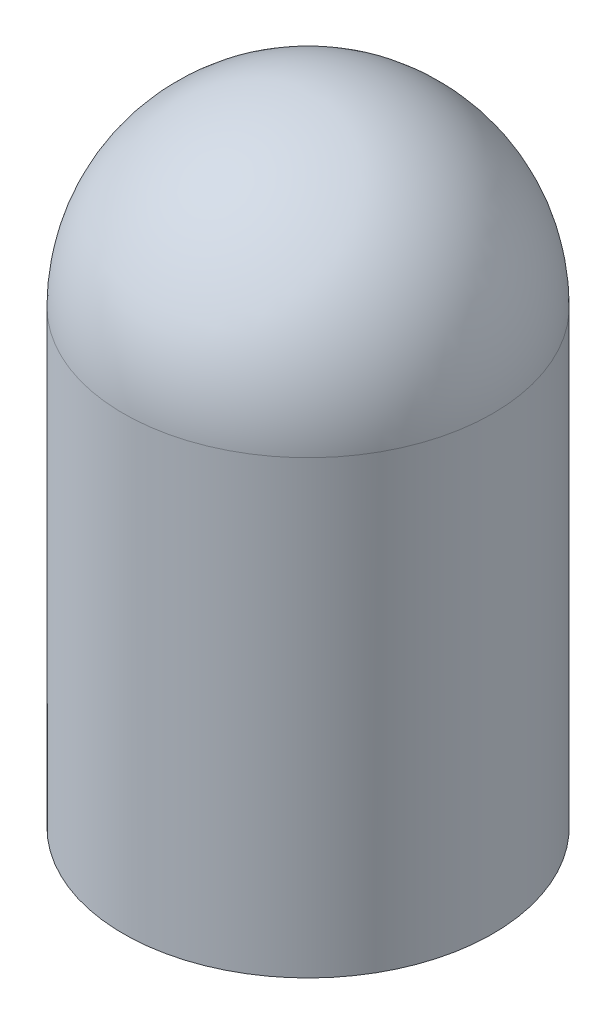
from build123d import *


with BuildPart() as part:
    # Sketch1 → Revolve5 (revolve)
    with BuildSketch(Plane.XY):
        with BuildLine():
            Line((0, 0), (2.5, 0))
            Line((2.5, 0), (2.5, 6.1))
            ThreePointArc((2.5, 6.1), (1.767766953, 7.867766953), (0, 8.6))
            Line((0, 8.6), (0, 0))
        make_face()
    revolve(axis=Axis((0, -1.695871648, 0), (0, 1, 0)))


solid = part.part
